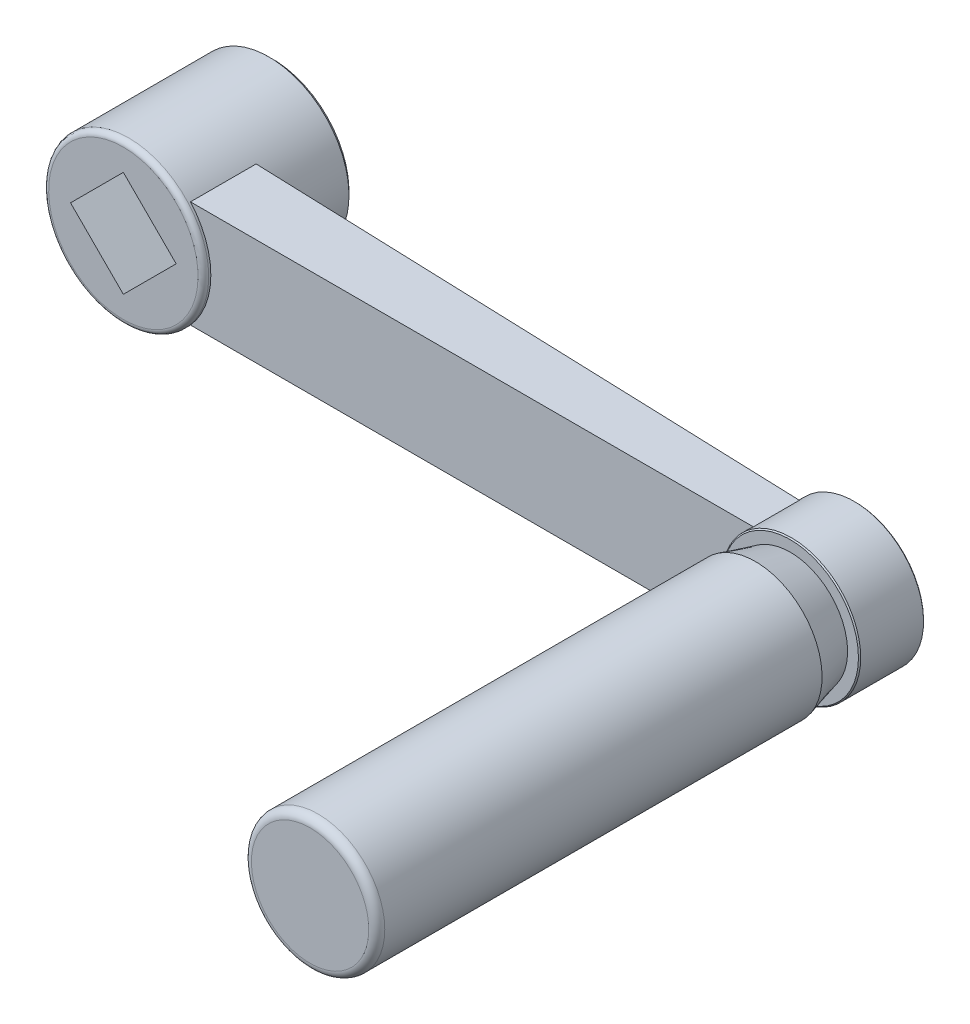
ISO-10303-21;
HEADER;
FILE_DESCRIPTION(('STEP AP214'),'2;1');
FILE_NAME('part.step','',(''),(''),'','','');
FILE_SCHEMA(('AUTOMOTIVE_DESIGN { 1 0 10303 214 1 1 1 1 }'));
ENDSEC;
DATA;
#1=APPLICATION_CONTEXT('core data for automotive mechanical design processes');
#2=APPLICATION_PROTOCOL_DEFINITION('international standard','automotive_design',2000,#1);
#3=PRODUCT_CONTEXT('',#1,'mechanical');
#4=PRODUCT('Part','Part','',(#3));
#5=PRODUCT_RELATED_PRODUCT_CATEGORY('part','',(#4));
#6=PRODUCT_DEFINITION_FORMATION('','',#4);
#7=PRODUCT_DEFINITION_CONTEXT('part definition',#1,'design');
#8=PRODUCT_DEFINITION('design','',#6,#7);
#9=PRODUCT_DEFINITION_SHAPE('','',#8);
#10=(LENGTH_UNIT() NAMED_UNIT(*) SI_UNIT(.MILLI.,.METRE.));
#11=(NAMED_UNIT(*) PLANE_ANGLE_UNIT() SI_UNIT($,.RADIAN.));
#12=(NAMED_UNIT(*) SI_UNIT($,.STERADIAN.) SOLID_ANGLE_UNIT());
#13=UNCERTAINTY_MEASURE_WITH_UNIT(LENGTH_MEASURE(1.E-05),#10,'distance_accuracy_value','');
#14=(GEOMETRIC_REPRESENTATION_CONTEXT(3) GLOBAL_UNCERTAINTY_ASSIGNED_CONTEXT((#13)) GLOBAL_UNIT_ASSIGNED_CONTEXT((#10,
#11,#12)) REPRESENTATION_CONTEXT('',''));
#15=CARTESIAN_POINT('',(0.,0.,0.));
#16=DIRECTION('',(0.,0.,1.));
#17=DIRECTION('',(1.,0.,0.));
#18=AXIS2_PLACEMENT_3D('',#15,#16,#17);
#19=CARTESIAN_POINT('',(128.233,0.,16.));
#20=DIRECTION('',(0.,0.,1.));
#21=DIRECTION('',(0.,-1.,0.));
#22=AXIS2_PLACEMENT_3D('',#19,#20,#21);
#23=PLANE('',#22);
#24=CARTESIAN_POINT('',(125.,0.,15.9999999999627));
#25=DIRECTION('',(0.,0.,1.));
#26=DIRECTION('',(0.,-1.,0.));
#27=AXIS2_PLACEMENT_3D('',#24,#25,#26);
#28=CIRCLE('',#27,3.23300000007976);
#29=CARTESIAN_POINT('',(125.,-3.23300000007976,15.9999999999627));
#30=VERTEX_POINT('',#29);
#31=EDGE_CURVE('E17',#30,#30,#28,.T.);
#32=ORIENTED_EDGE('',*,*,#31,.F.);
#33=EDGE_LOOP('',(#32));
#34=FACE_BOUND('',#33,.T.);
#35=ADVANCED_FACE('F14',(#34),#23,.F.);
#36=CARTESIAN_POINT('',(-9.89949493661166,0.,28.));
#37=DIRECTION('',(0.707106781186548,0.707106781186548,0.));
#38=DIRECTION('',(-0.707106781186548,0.707106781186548,0.));
#39=AXIS2_PLACEMENT_3D('',#36,#37,#38);
#40=PLANE('',#39);
#41=DIRECTION('',(0.707106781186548,-0.707106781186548,0.));
#42=VECTOR('',#41,1.);
#43=CARTESIAN_POINT('',(-9.89949493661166,0.,28.));
#44=LINE('',#43,#42);
#45=CARTESIAN_POINT('',(-9.89949493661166,0.,28.));
#46=VERTEX_POINT('',#45);
#47=CARTESIAN_POINT('',(0.,-9.89949493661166,28.));
#48=VERTEX_POINT('',#47);
#49=EDGE_CURVE('E299',#46,#48,#44,.T.);
#50=ORIENTED_EDGE('',*,*,#49,.T.);
#51=DIRECTION('',(0.,0.,1.));
#52=VECTOR('',#51,1.);
#53=CARTESIAN_POINT('',(0.,-9.89949493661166,28.));
#54=LINE('',#53,#52);
#55=CARTESIAN_POINT('',(0.,-9.89949493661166,0.));
#56=VERTEX_POINT('',#55);
#57=EDGE_CURVE('E92',#56,#48,#54,.T.);
#58=ORIENTED_EDGE('',*,*,#57,.F.);
#59=DIRECTION('',(-0.707106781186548,0.707106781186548,0.));
#60=VECTOR('',#59,1.);
#61=CARTESIAN_POINT('',(0.,-9.89949493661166,0.));
#62=LINE('',#61,#60);
#63=CARTESIAN_POINT('',(-9.89949493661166,0.,0.));
#64=VERTEX_POINT('',#63);
#65=EDGE_CURVE('E86',#56,#64,#62,.T.);
#66=ORIENTED_EDGE('',*,*,#65,.T.);
#67=DIRECTION('',(0.,0.,1.));
#68=VECTOR('',#67,1.);
#69=CARTESIAN_POINT('',(-9.89949493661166,0.,28.));
#70=LINE('',#69,#68);
#71=EDGE_CURVE('E89',#46,#64,#70,.F.);
#72=ORIENTED_EDGE('',*,*,#71,.F.);
#73=EDGE_LOOP('',(#50,#58,#66,#72));
#74=FACE_BOUND('',#73,.T.);
#75=ADVANCED_FACE('F88',(#74),#40,.T.);
#76=CARTESIAN_POINT('',(0.,-9.89949493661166,28.));
#77=DIRECTION('',(-0.707106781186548,0.707106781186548,0.));
#78=DIRECTION('',(-0.707106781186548,-0.707106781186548,0.));
#79=AXIS2_PLACEMENT_3D('',#76,#77,#78);
#80=PLANE('',#79);
#81=DIRECTION('',(0.707106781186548,0.707106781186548,0.));
#82=VECTOR('',#81,1.);
#83=CARTESIAN_POINT('',(0.,-9.89949493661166,28.));
#84=LINE('',#83,#82);
#85=CARTESIAN_POINT('',(9.89949493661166,0.,28.));
#86=VERTEX_POINT('',#85);
#87=EDGE_CURVE('E300',#48,#86,#84,.T.);
#88=ORIENTED_EDGE('',*,*,#87,.T.);
#89=DIRECTION('',(0.,0.,1.));
#90=VECTOR('',#89,1.);
#91=CARTESIAN_POINT('',(9.89949493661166,0.,28.));
#92=LINE('',#91,#90);
#93=CARTESIAN_POINT('',(9.89949493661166,0.,0.));
#94=VERTEX_POINT('',#93);
#95=EDGE_CURVE('E117',#94,#86,#92,.T.);
#96=ORIENTED_EDGE('',*,*,#95,.F.);
#97=DIRECTION('',(-0.707106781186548,-0.707106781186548,0.));
#98=VECTOR('',#97,1.);
#99=CARTESIAN_POINT('',(9.89949493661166,0.,0.));
#100=LINE('',#99,#98);
#101=EDGE_CURVE('E112',#94,#56,#100,.T.);
#102=ORIENTED_EDGE('',*,*,#101,.T.);
#103=ORIENTED_EDGE('',*,*,#57,.T.);
#104=EDGE_LOOP('',(#88,#96,#102,#103));
#105=FACE_BOUND('',#104,.T.);
#106=ADVANCED_FACE('F199',(#105),#80,.T.);
#107=CARTESIAN_POINT('',(9.89949493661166,0.,28.));
#108=DIRECTION('',(-0.707106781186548,-0.707106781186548,0.));
#109=DIRECTION('',(0.707106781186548,-0.707106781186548,0.));
#110=AXIS2_PLACEMENT_3D('',#107,#108,#109);
#111=PLANE('',#110);
#112=DIRECTION('',(-0.707106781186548,0.707106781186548,0.));
#113=VECTOR('',#112,1.);
#114=CARTESIAN_POINT('',(9.89949493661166,0.,28.));
#115=LINE('',#114,#113);
#116=CARTESIAN_POINT('',(0.,9.89949493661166,28.));
#117=VERTEX_POINT('',#116);
#118=EDGE_CURVE('E64',#86,#117,#115,.T.);
#119=ORIENTED_EDGE('',*,*,#118,.T.);
#120=DIRECTION('',(0.,0.,1.));
#121=VECTOR('',#120,1.);
#122=CARTESIAN_POINT('',(0.,9.89949493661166,28.));
#123=LINE('',#122,#121);
#124=CARTESIAN_POINT('',(0.,9.89949493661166,0.));
#125=VERTEX_POINT('',#124);
#126=EDGE_CURVE('E106',#125,#117,#123,.T.);
#127=ORIENTED_EDGE('',*,*,#126,.F.);
#128=DIRECTION('',(0.707106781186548,-0.707106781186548,0.));
#129=VECTOR('',#128,1.);
#130=CARTESIAN_POINT('',(0.,9.89949493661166,0.));
#131=LINE('',#130,#129);
#132=EDGE_CURVE('E110',#125,#94,#131,.T.);
#133=ORIENTED_EDGE('',*,*,#132,.T.);
#134=ORIENTED_EDGE('',*,*,#95,.T.);
#135=EDGE_LOOP('',(#119,#127,#133,#134));
#136=FACE_BOUND('',#135,.T.);
#137=ADVANCED_FACE('F196',(#136),#111,.T.);
#138=CARTESIAN_POINT('',(0.,9.89949493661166,28.));
#139=DIRECTION('',(0.707106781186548,-0.707106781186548,0.));
#140=DIRECTION('',(0.707106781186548,0.707106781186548,0.));
#141=AXIS2_PLACEMENT_3D('',#138,#139,#140);
#142=PLANE('',#141);
#143=DIRECTION('',(-0.707106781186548,-0.707106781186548,0.));
#144=VECTOR('',#143,1.);
#145=CARTESIAN_POINT('',(0.,9.89949493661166,28.));
#146=LINE('',#145,#144);
#147=EDGE_CURVE('E104',#117,#46,#146,.T.);
#148=ORIENTED_EDGE('',*,*,#147,.T.);
#149=ORIENTED_EDGE('',*,*,#71,.T.);
#150=DIRECTION('',(0.707106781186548,0.707106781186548,0.));
#151=VECTOR('',#150,1.);
#152=CARTESIAN_POINT('',(-9.89949493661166,0.,0.));
#153=LINE('',#152,#151);
#154=EDGE_CURVE('E97',#64,#125,#153,.T.);
#155=ORIENTED_EDGE('',*,*,#154,.T.);
#156=ORIENTED_EDGE('',*,*,#126,.T.);
#157=EDGE_LOOP('',(#148,#149,#155,#156));
#158=FACE_BOUND('',#157,.T.);
#159=ADVANCED_FACE('F101',(#158),#142,.T.);
#160=CARTESIAN_POINT('',(125.,0.,16.283499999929));
#161=DIRECTION('',(0.,0.,1.));
#162=DIRECTION('',(0.,-1.,0.));
#163=AXIS2_PLACEMENT_3D('',#160,#161,#162);
#164=CONICAL_SURFACE('',#163,3.51649999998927,0.785398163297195);
#165=CARTESIAN_POINT('',(125.,0.,16.2834999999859));
#166=DIRECTION('',(0.,0.,-1.));
#167=DIRECTION('',(0.,1.,0.));
#168=AXIS2_PLACEMENT_3D('',#165,#166,#167);
#169=CIRCLE('',#168,3.51649999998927);
#170=CARTESIAN_POINT('',(125.,3.51649999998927,16.2834999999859));
#171=VERTEX_POINT('',#170);
#172=EDGE_CURVE('E153',#171,#171,#169,.T.);
#173=ORIENTED_EDGE('',*,*,#172,.T.);
#174=EDGE_LOOP('',(#173));
#175=FACE_BOUND('',#174,.T.);
#176=ORIENTED_EDGE('',*,*,#31,.T.);
#177=EDGE_LOOP('',(#176));
#178=FACE_BOUND('',#177,.T.);
#179=ADVANCED_FACE('F190',(#175,#178),#164,.T.);
#180=CARTESIAN_POINT('',(14.2928932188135,0.,0.));
#181=DIRECTION('',(0.,0.,1.));
#182=DIRECTION('',(0.,-1.,0.));
#183=AXIS2_PLACEMENT_3D('',#180,#181,#182);
#184=PLANE('',#183);
#185=CARTESIAN_POINT('',(0.,0.,0.));
#186=DIRECTION('',(0.,0.,1.));
#187=DIRECTION('',(0.,-1.,0.));
#188=AXIS2_PLACEMENT_3D('',#185,#186,#187);
#189=CIRCLE('',#188,14.2928932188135);
#190=CARTESIAN_POINT('',(0.,-14.2928932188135,0.));
#191=VERTEX_POINT('',#190);
#192=EDGE_CURVE('E151',#191,#191,#189,.T.);
#193=ORIENTED_EDGE('',*,*,#192,.F.);
#194=EDGE_LOOP('',(#193));
#195=FACE_BOUND('',#194,.T.);
#196=ORIENTED_EDGE('',*,*,#132,.F.);
#197=ORIENTED_EDGE('',*,*,#154,.F.);
#198=ORIENTED_EDGE('',*,*,#65,.F.);
#199=ORIENTED_EDGE('',*,*,#101,.F.);
#200=EDGE_LOOP('',(#196,#197,#198,#199));
#201=FACE_BOUND('',#200,.T.);
#202=ADVANCED_FACE('F108',(#195,#201),#184,.F.);
#203=CARTESIAN_POINT('',(0.,0.,28.));
#204=DIRECTION('',(0.,0.,-1.));
#205=DIRECTION('',(0.,1.,0.));
#206=AXIS2_PLACEMENT_3D('',#203,#204,#205);
#207=PLANE('',#206);
#208=ORIENTED_EDGE('',*,*,#118,.F.);
#209=ORIENTED_EDGE('',*,*,#87,.F.);
#210=ORIENTED_EDGE('',*,*,#49,.F.);
#211=ORIENTED_EDGE('',*,*,#147,.F.);
#212=EDGE_LOOP('',(#208,#209,#210,#211));
#213=FACE_BOUND('',#212,.T.);
#214=CARTESIAN_POINT('',(0.,0.,28.));
#215=DIRECTION('',(0.,0.,-1.));
#216=DIRECTION('',(0.,1.,0.));
#217=AXIS2_PLACEMENT_3D('',#214,#215,#216);
#218=CIRCLE('',#217,14.);
#219=CARTESIAN_POINT('',(0.,14.,28.));
#220=VERTEX_POINT('',#219);
#221=EDGE_CURVE('E150',#220,#220,#218,.T.);
#222=ORIENTED_EDGE('',*,*,#221,.F.);
#223=EDGE_LOOP('',(#222));
#224=FACE_BOUND('',#223,.T.);
#225=ADVANCED_FACE('F175',(#213,#224),#207,.F.);
#226=CARTESIAN_POINT('',(125.,0.,15.8000000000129));
#227=DIRECTION('',(0.,0.,-1.));
#228=DIRECTION('',(0.,1.,0.));
#229=AXIS2_PLACEMENT_3D('',#226,#227,#228);
#230=CONICAL_SURFACE('',#229,3.99999999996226,0.785398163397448);
#231=ORIENTED_EDGE('',*,*,#172,.F.);
#232=EDGE_LOOP('',(#231));
#233=FACE_BOUND('',#232,.T.);
#234=CARTESIAN_POINT('',(125.,0.,15.8000000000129));
#235=DIRECTION('',(0.,0.,-1.));
#236=DIRECTION('',(0.,1.,0.));
#237=AXIS2_PLACEMENT_3D('',#234,#235,#236);
#238=CIRCLE('',#237,3.99999999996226);
#239=CARTESIAN_POINT('',(125.,3.99999999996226,15.8000000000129));
#240=VERTEX_POINT('',#239);
#241=EDGE_CURVE('E147',#240,#240,#238,.F.);
#242=ORIENTED_EDGE('',*,*,#241,.F.);
#243=EDGE_LOOP('',(#242));
#244=FACE_BOUND('',#243,.T.);
#245=ADVANCED_FACE('F185',(#233,#244),#230,.F.);
#246=CARTESIAN_POINT('',(0.,0.,0.707106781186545));
#247=DIRECTION('',(0.,0.,1.));
#248=DIRECTION('',(0.,-1.,0.));
#249=AXIS2_PLACEMENT_3D('',#246,#247,#248);
#250=CONICAL_SURFACE('',#249,15.,0.78539816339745);
#251=CARTESIAN_POINT('',(0.,0.,0.707106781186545));
#252=DIRECTION('',(0.,0.,1.));
#253=DIRECTION('',(0.,-1.,0.));
#254=AXIS2_PLACEMENT_3D('',#251,#252,#253);
#255=CIRCLE('',#254,15.);
#256=CARTESIAN_POINT('',(0.,-15.,0.707106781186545));
#257=VERTEX_POINT('',#256);
#258=EDGE_CURVE('E149',#257,#257,#255,.T.);
#259=ORIENTED_EDGE('',*,*,#258,.F.);
#260=EDGE_LOOP('',(#259));
#261=FACE_BOUND('',#260,.T.);
#262=ORIENTED_EDGE('',*,*,#192,.T.);
#263=EDGE_LOOP('',(#262));
#264=FACE_BOUND('',#263,.T.);
#265=ADVANCED_FACE('F287',(#261,#264),#250,.T.);
#266=CARTESIAN_POINT('',(0.,0.,27.));
#267=DIRECTION('',(0.,0.,-1.));
#268=DIRECTION('',(0.,1.,0.));
#269=AXIS2_PLACEMENT_3D('',#266,#267,#268);
#270=TOROIDAL_SURFACE('',#269,14.,1.);
#271=CARTESIAN_POINT('',(0.,0.,27.));
#272=DIRECTION('',(0.,0.,1.));
#273=DIRECTION('',(0.,-1.,0.));
#274=AXIS2_PLACEMENT_3D('',#271,#272,#273);
#275=CIRCLE('',#274,15.);
#276=CARTESIAN_POINT('',(0.,-15.,27.));
#277=VERTEX_POINT('',#276);
#278=EDGE_CURVE('E146',#277,#277,#275,.F.);
#279=ORIENTED_EDGE('',*,*,#278,.F.);
#280=EDGE_LOOP('',(#279));
#281=FACE_BOUND('',#280,.T.);
#282=ORIENTED_EDGE('',*,*,#221,.T.);
#283=EDGE_LOOP('',(#282));
#284=FACE_BOUND('',#283,.T.);
#285=ADVANCED_FACE('F283',(#281,#284),#270,.T.);
#286=CARTESIAN_POINT('',(129.,0.,15.8));
#287=DIRECTION('',(0.,0.,-1.));
#288=DIRECTION('',(0.,1.,0.));
#289=AXIS2_PLACEMENT_3D('',#286,#287,#288);
#290=PLANE('',#289);
#291=ORIENTED_EDGE('',*,*,#241,.T.);
#292=EDGE_LOOP('',(#291));
#293=FACE_BOUND('',#292,.T.);
#294=CARTESIAN_POINT('',(125.,0.,15.8));
#295=DIRECTION('',(0.,0.,1.));
#296=DIRECTION('',(0.,-1.,0.));
#297=AXIS2_PLACEMENT_3D('',#294,#295,#296);
#298=CIRCLE('',#297,12.787867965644);
#299=CARTESIAN_POINT('',(125.,-12.787867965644,15.8));
#300=VERTEX_POINT('',#299);
#301=EDGE_CURVE('E143',#300,#300,#298,.T.);
#302=ORIENTED_EDGE('',*,*,#301,.F.);
#303=EDGE_LOOP('',(#302));
#304=FACE_BOUND('',#303,.T.);
#305=ADVANCED_FACE('F279',(#293,#304),#290,.T.);
#306=CARTESIAN_POINT('',(0.,0.,0.));
#307=DIRECTION('',(0.,0.,1.));
#308=DIRECTION('',(0.,-1.,0.));
#309=AXIS2_PLACEMENT_3D('',#306,#307,#308);
#310=CYLINDRICAL_SURFACE('',#309,15.);
#311=ORIENTED_EDGE('',*,*,#278,.T.);
#312=EDGE_LOOP('',(#311));
#313=FACE_BOUND('',#312,.T.);
#314=CARTESIAN_POINT('',(0.,0.,13.9));
#315=DIRECTION('',(-0.034899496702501,0.,0.999390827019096));
#316=DIRECTION('',(0.999390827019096,0.,0.034899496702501));
#317=AXIS2_PLACEMENT_3D('',#314,#315,#316);
#318=ELLIPSE('',#317,15.0091431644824,15.);
#319=CARTESIAN_POINT('',(11.1803398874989,10.,14.2904260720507));
#320=VERTEX_POINT('',#319);
#321=CARTESIAN_POINT('',(11.1803398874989,-10.,14.2904260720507));
#322=VERTEX_POINT('',#321);
#323=EDGE_CURVE('E55',#320,#322,#318,.F.);
#324=ORIENTED_EDGE('',*,*,#323,.T.);
#325=DIRECTION('',(0.,0.,1.));
#326=VECTOR('',#325,1.);
#327=CARTESIAN_POINT('',(11.1803398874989,-10.,0.));
#328=LINE('',#327,#326);
#329=CARTESIAN_POINT('',(11.1803398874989,-10.,26.6));
#330=VERTEX_POINT('',#329);
#331=EDGE_CURVE('E328',#322,#330,#328,.T.);
#332=ORIENTED_EDGE('',*,*,#331,.T.);
#333=CARTESIAN_POINT('',(0.,0.,26.6));
#334=DIRECTION('',(0.,0.,1.));
#335=DIRECTION('',(0.,-1.,0.));
#336=AXIS2_PLACEMENT_3D('',#333,#334,#335);
#337=CIRCLE('',#336,15.);
#338=CARTESIAN_POINT('',(11.1803398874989,10.,26.6));
#339=VERTEX_POINT('',#338);
#340=EDGE_CURVE('E137',#330,#339,#337,.T.);
#341=ORIENTED_EDGE('',*,*,#340,.T.);
#342=DIRECTION('',(0.,0.,1.));
#343=VECTOR('',#342,1.);
#344=CARTESIAN_POINT('',(11.1803398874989,10.,0.));
#345=LINE('',#344,#343);
#346=EDGE_CURVE('E140',#320,#339,#345,.T.);
#347=ORIENTED_EDGE('',*,*,#346,.F.);
#348=EDGE_LOOP('',(#324,#332,#341,#347));
#349=FACE_BOUND('',#348,.T.);
#350=ORIENTED_EDGE('',*,*,#258,.T.);
#351=EDGE_LOOP('',(#350));
#352=FACE_BOUND('',#351,.T.);
#353=ADVANCED_FACE('F275',(#313,#349,#352),#310,.T.);
#354=CARTESIAN_POINT('',(125.,0.,16.012132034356));
#355=DIRECTION('',(0.,0.,1.));
#356=DIRECTION('',(0.,-1.,0.));
#357=AXIS2_PLACEMENT_3D('',#354,#355,#356);
#358=CONICAL_SURFACE('',#357,13.,0.785398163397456);
#359=ORIENTED_EDGE('',*,*,#301,.T.);
#360=EDGE_LOOP('',(#359));
#361=FACE_BOUND('',#360,.T.);
#362=CARTESIAN_POINT('',(125.,0.,16.012132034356));
#363=DIRECTION('',(0.,0.,1.));
#364=DIRECTION('',(0.,-1.,0.));
#365=AXIS2_PLACEMENT_3D('',#362,#363,#364);
#366=CIRCLE('',#365,13.);
#367=CARTESIAN_POINT('',(125.,-13.,16.012132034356));
#368=VERTEX_POINT('',#367);
#369=EDGE_CURVE('E136',#368,#368,#366,.T.);
#370=ORIENTED_EDGE('',*,*,#369,.F.);
#371=EDGE_LOOP('',(#370));
#372=FACE_BOUND('',#371,.T.);
#373=ADVANCED_FACE('F272',(#361,#372),#358,.T.);
#374=CARTESIAN_POINT('',(0.,-10.,13.9));
#375=DIRECTION('',(-0.034899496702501,0.,0.999390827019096));
#376=DIRECTION('',(-0.999390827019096,0.,-0.034899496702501));
#377=AXIS2_PLACEMENT_3D('',#374,#375,#376);
#378=PLANE('',#377);
#379=CARTESIAN_POINT('',(125.,0.,18.2650961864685));
#380=DIRECTION('',(-0.034899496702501,0.,0.999390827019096));
#381=DIRECTION('',(0.999390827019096,0.,0.034899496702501));
#382=AXIS2_PLACEMENT_3D('',#379,#380,#381);
#383=ELLIPSE('',#382,13.0079240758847,13.);
#384=CARTESIAN_POINT('',(116.693376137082,-10.,17.9750224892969));
#385=VERTEX_POINT('',#384);
#386=CARTESIAN_POINT('',(116.693376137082,10.,17.9750224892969));
#387=VERTEX_POINT('',#386);
#388=EDGE_CURVE('E133',#385,#387,#383,.F.);
#389=ORIENTED_EDGE('',*,*,#388,.F.);
#390=DIRECTION('',(-0.999390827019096,0.,-0.0348994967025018));
#391=VECTOR('',#390,1.);
#392=CARTESIAN_POINT('',(116.693376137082,-10.,17.9750224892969));
#393=LINE('',#392,#391);
#394=EDGE_CURVE('E331',#385,#322,#393,.T.);
#395=ORIENTED_EDGE('',*,*,#394,.T.);
#396=ORIENTED_EDGE('',*,*,#323,.F.);
#397=DIRECTION('',(-0.999390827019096,0.,-0.0348994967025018));
#398=VECTOR('',#397,1.);
#399=CARTESIAN_POINT('',(116.693376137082,10.,17.9750224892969));
#400=LINE('',#399,#398);
#401=EDGE_CURVE('E142',#387,#320,#400,.T.);
#402=ORIENTED_EDGE('',*,*,#401,.F.);
#403=EDGE_LOOP('',(#389,#395,#396,#402));
#404=FACE_BOUND('',#403,.T.);
#405=ADVANCED_FACE('F268',(#404),#378,.F.);
#406=CARTESIAN_POINT('',(0.,10.,0.));
#407=DIRECTION('',(0.,1.,0.));
#408=DIRECTION('',(-1.,0.,0.));
#409=AXIS2_PLACEMENT_3D('',#406,#407,#408);
#410=PLANE('',#409);
#411=ORIENTED_EDGE('',*,*,#346,.T.);
#412=DIRECTION('',(1.,0.,0.));
#413=VECTOR('',#412,1.);
#414=CARTESIAN_POINT('',(120.,10.,26.6));
#415=LINE('',#414,#413);
#416=CARTESIAN_POINT('',(116.693376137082,10.,26.6));
#417=VERTEX_POINT('',#416);
#418=EDGE_CURVE('E139',#339,#417,#415,.T.);
#419=ORIENTED_EDGE('',*,*,#418,.T.);
#420=DIRECTION('',(0.,0.,1.));
#421=VECTOR('',#420,1.);
#422=CARTESIAN_POINT('',(116.693376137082,10.,15.8));
#423=LINE('',#422,#421);
#424=EDGE_CURVE('E132',#387,#417,#423,.T.);
#425=ORIENTED_EDGE('',*,*,#424,.F.);
#426=ORIENTED_EDGE('',*,*,#401,.T.);
#427=EDGE_LOOP('',(#411,#419,#425,#426));
#428=FACE_BOUND('',#427,.T.);
#429=ADVANCED_FACE('F265',(#428),#410,.T.);
#430=CARTESIAN_POINT('',(120.,-10.,26.6));
#431=DIRECTION('',(0.,0.,-1.));
#432=DIRECTION('',(0.,1.,0.));
#433=AXIS2_PLACEMENT_3D('',#430,#431,#432);
#434=PLANE('',#433);
#435=CARTESIAN_POINT('',(125.,0.,26.6));
#436=DIRECTION('',(0.,0.,1.));
#437=DIRECTION('',(0.,-1.,0.));
#438=AXIS2_PLACEMENT_3D('',#435,#436,#437);
#439=CIRCLE('',#438,13.);
#440=CARTESIAN_POINT('',(116.693376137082,-10.,26.6));
#441=VERTEX_POINT('',#440);
#442=EDGE_CURVE('E128',#417,#441,#439,.T.);
#443=ORIENTED_EDGE('',*,*,#442,.F.);
#444=ORIENTED_EDGE('',*,*,#418,.F.);
#445=ORIENTED_EDGE('',*,*,#340,.F.);
#446=DIRECTION('',(-1.,0.,0.));
#447=VECTOR('',#446,1.);
#448=CARTESIAN_POINT('',(0.,-10.,26.6));
#449=LINE('',#448,#447);
#450=EDGE_CURVE('E32',#330,#441,#449,.F.);
#451=ORIENTED_EDGE('',*,*,#450,.T.);
#452=EDGE_LOOP('',(#443,#444,#445,#451));
#453=FACE_BOUND('',#452,.T.);
#454=ADVANCED_FACE('F261',(#453),#434,.F.);
#455=CARTESIAN_POINT('',(0.,-10.,0.));
#456=DIRECTION('',(0.,1.,0.));
#457=DIRECTION('',(-1.,0.,0.));
#458=AXIS2_PLACEMENT_3D('',#455,#456,#457);
#459=PLANE('',#458);
#460=DIRECTION('',(0.,0.,1.));
#461=VECTOR('',#460,1.);
#462=CARTESIAN_POINT('',(116.693376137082,-10.,15.8));
#463=LINE('',#462,#461);
#464=EDGE_CURVE('E131',#441,#385,#463,.F.);
#465=ORIENTED_EDGE('',*,*,#464,.F.);
#466=ORIENTED_EDGE('',*,*,#450,.F.);
#467=ORIENTED_EDGE('',*,*,#331,.F.);
#468=ORIENTED_EDGE('',*,*,#394,.F.);
#469=EDGE_LOOP('',(#465,#466,#467,#468));
#470=FACE_BOUND('',#469,.T.);
#471=ADVANCED_FACE('F257',(#470),#459,.F.);
#472=CARTESIAN_POINT('',(125.,0.,15.8));
#473=DIRECTION('',(0.,0.,1.));
#474=DIRECTION('',(0.,-1.,0.));
#475=AXIS2_PLACEMENT_3D('',#472,#473,#474);
#476=CYLINDRICAL_SURFACE('',#475,13.);
#477=ORIENTED_EDGE('',*,*,#442,.T.);
#478=ORIENTED_EDGE('',*,*,#464,.T.);
#479=ORIENTED_EDGE('',*,*,#388,.T.);
#480=ORIENTED_EDGE('',*,*,#424,.T.);
#481=EDGE_LOOP('',(#477,#478,#479,#480));
#482=FACE_BOUND('',#481,.T.);
#483=ORIENTED_EDGE('',*,*,#369,.T.);
#484=EDGE_LOOP('',(#483));
#485=FACE_BOUND('',#484,.T.);
#486=CARTESIAN_POINT('',(125.,0.,27.787867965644));
#487=DIRECTION('',(0.,0.,-1.));
#488=DIRECTION('',(0.,1.,0.));
#489=AXIS2_PLACEMENT_3D('',#486,#487,#488);
#490=CIRCLE('',#489,13.);
#491=CARTESIAN_POINT('',(125.,13.,27.787867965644));
#492=VERTEX_POINT('',#491);
#493=EDGE_CURVE('E127',#492,#492,#490,.F.);
#494=ORIENTED_EDGE('',*,*,#493,.F.);
#495=EDGE_LOOP('',(#494));
#496=FACE_BOUND('',#495,.T.);
#497=ADVANCED_FACE('F253',(#482,#485,#496),#476,.T.);
#498=CARTESIAN_POINT('',(125.,0.,27.787867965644));
#499=DIRECTION('',(0.,0.,-1.));
#500=DIRECTION('',(1.,0.,0.));
#501=AXIS2_PLACEMENT_3D('',#498,#499,#500);
#502=CONICAL_SURFACE('',#501,13.,0.785398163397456);
#503=ORIENTED_EDGE('',*,*,#493,.T.);
#504=EDGE_LOOP('',(#503));
#505=FACE_BOUND('',#504,.T.);
#506=CARTESIAN_POINT('',(125.,0.,28.));
#507=DIRECTION('',(0.,0.,-1.));
#508=DIRECTION('',(1.,0.,0.));
#509=AXIS2_PLACEMENT_3D('',#506,#507,#508);
#510=CIRCLE('',#509,12.787867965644);
#511=CARTESIAN_POINT('',(137.787867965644,0.,28.));
#512=VERTEX_POINT('',#511);
#513=EDGE_CURVE('E124',#512,#512,#510,.F.);
#514=ORIENTED_EDGE('',*,*,#513,.F.);
#515=EDGE_LOOP('',(#514));
#516=FACE_BOUND('',#515,.T.);
#517=ADVANCED_FACE('F249',(#505,#516),#502,.T.);
#518=CARTESIAN_POINT('',(137.787867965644,0.,28.));
#519=DIRECTION('',(0.,0.,1.));
#520=DIRECTION('',(0.,-1.,0.));
#521=AXIS2_PLACEMENT_3D('',#518,#519,#520);
#522=PLANE('',#521);
#523=ORIENTED_EDGE('',*,*,#513,.T.);
#524=EDGE_LOOP('',(#523));
#525=FACE_BOUND('',#524,.T.);
#526=CARTESIAN_POINT('',(125.,0.,28.));
#527=DIRECTION('',(0.,0.,1.));
#528=DIRECTION('',(-1.,0.,0.));
#529=AXIS2_PLACEMENT_3D('',#526,#527,#528);
#530=CIRCLE('',#529,10.75);
#531=CARTESIAN_POINT('',(114.25,0.,28.));
#532=VERTEX_POINT('',#531);
#533=EDGE_CURVE('E120',#532,#532,#530,.T.);
#534=ORIENTED_EDGE('',*,*,#533,.F.);
#535=EDGE_LOOP('',(#534));
#536=FACE_BOUND('',#535,.T.);
#537=ADVANCED_FACE('F246',(#525,#536),#522,.T.);
#538=CARTESIAN_POINT('',(125.,0.,118.));
#539=DIRECTION('',(0.,0.,-1.));
#540=DIRECTION('',(0.,1.,0.));
#541=AXIS2_PLACEMENT_3D('',#538,#539,#540);
#542=PLANE('',#541);
#543=CARTESIAN_POINT('',(125.,0.,118.));
#544=DIRECTION('',(0.,0.,-1.));
#545=DIRECTION('',(0.,1.,0.));
#546=AXIS2_PLACEMENT_3D('',#543,#544,#545);
#547=CIRCLE('',#546,11.);
#548=CARTESIAN_POINT('',(125.,11.,118.));
#549=VERTEX_POINT('',#548);
#550=EDGE_CURVE('E123',#549,#549,#547,.T.);
#551=ORIENTED_EDGE('',*,*,#550,.F.);
#552=EDGE_LOOP('',(#551));
#553=FACE_BOUND('',#552,.T.);
#554=ADVANCED_FACE('F237',(#553),#542,.F.);
#555=CARTESIAN_POINT('',(125.,0.,34.5310889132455));
#556=DIRECTION('',(0.,0.,1.));
#557=DIRECTION('',(-1.,0.,0.));
#558=AXIS2_PLACEMENT_3D('',#555,#556,#557);
#559=CONICAL_SURFACE('',#558,12.5,0.26179938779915);
#560=CARTESIAN_POINT('',(125.,0.,34.5310889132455));
#561=DIRECTION('',(0.,0.,1.));
#562=DIRECTION('',(0.,-1.,0.));
#563=AXIS2_PLACEMENT_3D('',#560,#561,#562);
#564=CIRCLE('',#563,12.5);
#565=CARTESIAN_POINT('',(125.,-12.5,34.5310889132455));
#566=VERTEX_POINT('',#565);
#567=EDGE_CURVE('E23',#566,#566,#564,.T.);
#568=ORIENTED_EDGE('',*,*,#567,.F.);
#569=EDGE_LOOP('',(#568));
#570=FACE_BOUND('',#569,.T.);
#571=ORIENTED_EDGE('',*,*,#533,.T.);
#572=EDGE_LOOP('',(#571));
#573=FACE_BOUND('',#572,.T.);
#574=ADVANCED_FACE('F216',(#570,#573),#559,.T.);
#575=CARTESIAN_POINT('',(125.,0.,116.5));
#576=DIRECTION('',(0.,0.,-1.));
#577=DIRECTION('',(0.,1.,0.));
#578=AXIS2_PLACEMENT_3D('',#575,#576,#577);
#579=TOROIDAL_SURFACE('',#578,11.,1.5);
#580=CARTESIAN_POINT('',(125.,0.,116.5));
#581=DIRECTION('',(0.,0.,1.));
#582=DIRECTION('',(0.,-1.,0.));
#583=AXIS2_PLACEMENT_3D('',#580,#581,#582);
#584=CIRCLE('',#583,12.5);
#585=CARTESIAN_POINT('',(125.,-12.5,116.5));
#586=VERTEX_POINT('',#585);
#587=EDGE_CURVE('E9',#586,#586,#584,.F.);
#588=ORIENTED_EDGE('',*,*,#587,.F.);
#589=EDGE_LOOP('',(#588));
#590=FACE_BOUND('',#589,.T.);
#591=ORIENTED_EDGE('',*,*,#550,.T.);
#592=EDGE_LOOP('',(#591));
#593=FACE_BOUND('',#592,.T.);
#594=ADVANCED_FACE('F210',(#590,#593),#579,.T.);
#595=CARTESIAN_POINT('',(125.,0.,16.));
#596=DIRECTION('',(0.,0.,1.));
#597=DIRECTION('',(0.,-1.,0.));
#598=AXIS2_PLACEMENT_3D('',#595,#596,#597);
#599=CYLINDRICAL_SURFACE('',#598,12.5);
#600=ORIENTED_EDGE('',*,*,#587,.T.);
#601=EDGE_LOOP('',(#600));
#602=FACE_BOUND('',#601,.T.);
#603=ORIENTED_EDGE('',*,*,#567,.T.);
#604=EDGE_LOOP('',(#603));
#605=FACE_BOUND('',#604,.T.);
#606=ADVANCED_FACE('F208',(#602,#605),#599,.T.);
#607=CLOSED_SHELL('',(#35,#75,#106,#137,#159,#179,#202,#225,#245,#265,#285,#305,#353,#373,#405,
#429,#454,#471,#497,#517,#537,#554,#574,#594,#606));
#608=MANIFOLD_SOLID_BREP('B1',#607);
#609=ADVANCED_BREP_SHAPE_REPRESENTATION('',(#18,#608),#14);
#610=SHAPE_DEFINITION_REPRESENTATION(#9,#609);
ENDSEC;
END-ISO-10303-21;
